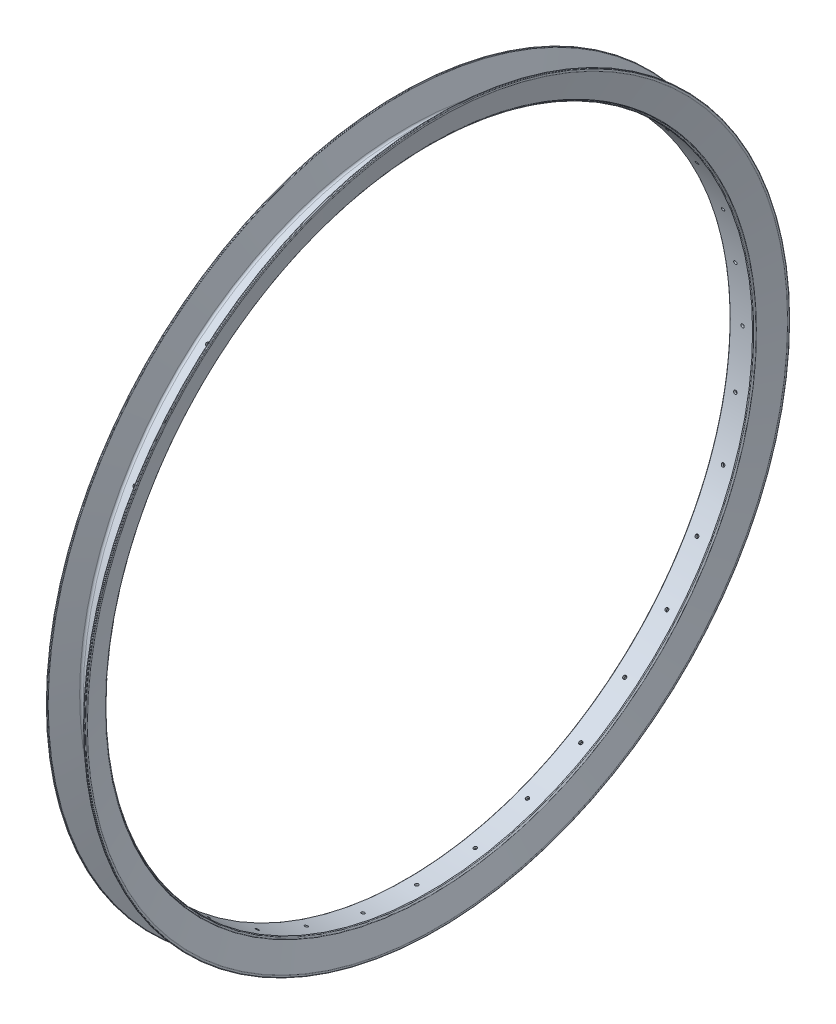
from build123d import *

# Parameters (mm, degrees)
GAURA_STG_REACH         = 685.281
GAURA_STG_END_RADIUS    = 292.025905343
SKETCH2_R               = 1.5
CIRPATTERN1_COUNT       = 18
GAURA_DR_REACH          = 685.281
GAURA_DR_END_RADIUS     = 292.025905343
SKETCH8_R               = 1.5
CIRPATTERN2_COUNT       = 18
CUT_EXTRUDE1_REACH      = 685.281
CUT_EXTRUDE1_END_RADIUS = 292.025905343
SKETCH9_R               = 5


with BuildPart() as part:
    # Sketch1 → Revolve1 (revolve)
    with BuildSketch(Plane.XY, mode=Mode.PRIVATE) as revolve1_sk:
        with BuildLine():
            Line((-9.963690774, 0.5), (10.036242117, 0.5))
            ThreePointArc((10.036242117, 0.5), (10.46056712, 0.675796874), (10.636242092, 1.100172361))
            ThreePointArc((10.636242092, 1.100172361), (10.807747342, 1.66045652), (11.263701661, 2.028475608))
            ThreePointArc((11.263701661, 2.028475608), (11.489107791, 2.18721293), (11.619732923, 2.429993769))
            Line((11.619732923, 2.429993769), (17.502201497, 24.383665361))
            ThreePointArc((17.502201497, 24.383665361), (17.527720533, 24.511958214), (17.536275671, 24.642484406))
            Line((17.536275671, 24.642484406), (17.536275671, 26))
            ThreePointArc((17.536275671, 26), (17.389829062, 26.353553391), (17.036275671, 26.5))
            Line((17.036275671, 26.5), (16.382382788, 26.5))
            ThreePointArc((16.382382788, 26.5), (16.078002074, 26.39667667), (15.899419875, 26.129409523))
            Line((15.899419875, 26.129409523), (9.965136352, 3.98236191))
            ThreePointArc((9.965136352, 3.98236191), (9.250807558, 2.913293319), (8.0332847, 2.5))
            Line((8.0332847, 2.5), (-7.960733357, 2.5))
            ThreePointArc((-7.960733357, 2.5), (-9.178256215, 2.913293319), (-9.89258501, 3.98236191))
            Line((-9.89258501, 3.98236191), (-15.826868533, 26.129409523))
            ThreePointArc((-15.826868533, 26.129409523), (-16.005450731, 26.39667667), (-16.309831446, 26.5))
            Line((-16.309831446, 26.5), (-16.963724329, 26.5))
            ThreePointArc((-16.963724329, 26.5), (-17.317277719, 26.353553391), (-17.463724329, 26))
            Line((-17.463724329, 26), (-17.463724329, 24.642484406))
            ThreePointArc((-17.463724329, 24.642484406), (-17.45516919, 24.511958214), (-17.429650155, 24.383665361))
            Line((-17.429650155, 24.383665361), (-11.547181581, 2.429993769))
            ThreePointArc((-11.547181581, 2.429993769), (-11.416556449, 2.18721293), (-11.191150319, 2.028475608))
            ThreePointArc((-11.191150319, 2.028475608), (-10.735196, 1.66045652), (-10.56369075, 1.100172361))
            ThreePointArc((-10.56369075, 1.100172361), (-10.388015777, 0.675796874), (-9.963690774, 0.5))
        make_face()
    revolve(revolve1_sk.sketch.rotate(Axis((-3.658509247, -289.525905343, 0), (1, 0, 0)), 90), axis=Axis((-3.658509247, -289.525905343, 0), (1, 0, 0)))

    # gaura stg: up to this cylinder (the profile starts inside it)
    gaura_stg_end = Plane(origin=(-1, -289.525905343, 0), z_dir=(-1, 0, 0)) * Cylinder(GAURA_STG_END_RADIUS, 1955.613810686, mode=Mode.PRIVATE)
    # Sketch2 → gaura stg (cut, up to the surface)
    with BuildSketch(Plane(origin=(0, 0, 0), x_dir=(1, 0, 0), z_dir=(0, 1, 0)), mode=Mode.PRIVATE) as gaura_stg_sk1:
        with Locations(Location((-1, 0, 0), (0, 0, 90))):
            Circle(SKETCH2_R)
    gaura_stg_tool1 = extrude(gaura_stg_sk1.sketch, amount=GAURA_STG_REACH, mode=Mode.PRIVATE) & gaura_stg_end
    gaura_stg = gaura_stg_tool1.solids().sort_by_distance((-1, 0, 0))[0]
    add(gaura_stg, mode=Mode.SUBTRACT)

    # CirPattern1: gaura stg ×18 about axis
    cirpattern1_axis = Axis((-3.658509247, -289.525905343, 0), (-1, 0, 0))
    for i in range(1, CIRPATTERN1_COUNT):
        add(gaura_stg.rotate(cirpattern1_axis, i * 360 / CIRPATTERN1_COUNT), mode=Mode.SUBTRACT)

    # gaura dr: up to this cylinder (the profile starts inside it)
    gaura_dr_end = Plane(origin=(1.036276, -289.525905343, 0), z_dir=(-1, 0, 0)) * Cylinder(GAURA_DR_END_RADIUS, 1955.613810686, mode=Mode.PRIVATE)
    # Sketch8 → gaura dr (cut, up to the surface)
    with BuildSketch(Plane(origin=(0, 0, 0), x_dir=(-1, 0, 0), z_dir=(0, -0.9848077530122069, 0.1736481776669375)), mode=Mode.PRIVATE) as gaura_dr_sk1:
        with Locations(Location((-1.036275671, 50.275645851, 0), (0, 0, 90))):
            Circle(SKETCH8_R)
    gaura_dr_tool1 = extrude(gaura_dr_sk1.sketch, amount=-GAURA_DR_REACH, mode=Mode.PRIVATE) & gaura_dr_end
    gaura_dr = gaura_dr_tool1.solids().sort_by_distance((1.036276, -8.730274, -49.511846))[0]
    add(gaura_dr, mode=Mode.SUBTRACT)

    # CirPattern2: gaura dr ×18 about axis
    cirpattern2_axis = Axis((0, -289.525905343, 0), (1, 0, 0))
    for i in range(1, CIRPATTERN2_COUNT):
        add(gaura_dr.rotate(cirpattern2_axis, i * 360 / CIRPATTERN2_COUNT), mode=Mode.SUBTRACT)

    # Cut-Extrude1: up to this cylinder (the profile starts inside it)
    cut_extrude1_end = Plane(origin=(-0.013076, -289.525905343, 0), z_dir=(-1, 0, 0)) * Cylinder(CUT_EXTRUDE1_END_RADIUS, 1955.613810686, mode=Mode.PRIVATE)
    # Sketch9 → Cut-Extrude1 (cut, up to the surface)
    with BuildSketch(Plane(origin=(0, 0, 0), x_dir=(-1, 0, 0), z_dir=(0, -0.9848077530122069, 0.1736481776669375)), mode=Mode.PRIVATE) as cut_extrude1_sk1:
        with Locations(Location((0.013076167, 25.08400331, 0), (0, 0, 90))):
            Circle(SKETCH9_R)
    cut_extrude1_tool1 = extrude(cut_extrude1_sk1.sketch, amount=-CUT_EXTRUDE1_REACH, mode=Mode.PRIVATE) & cut_extrude1_end
    add(cut_extrude1_tool1.solids().sort_by_distance((-0.013076, -4.355791, -24.702921))[0], mode=Mode.SUBTRACT)


solid = part.part
